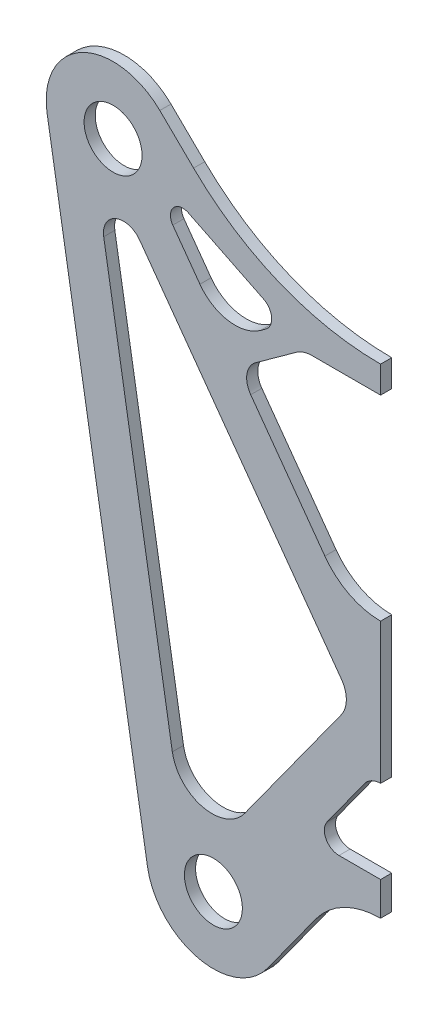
from build123d import *

# Parameters (mm, degrees)
SKIZZE1_R                       = 13
AUFSATZ_LINEAR_AUSTRAGEN1_DEPTH = 5


with BuildPart() as part:
    # Skizze1 → Aufsatz-Linear austragen1 (new body)
    with BuildSketch(Plane.XY):
        with BuildLine():
            Line((-68.917466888, 5.058071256), (-68.917466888, -7.004742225))
            Line((-68.917466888, -7.004742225), (-93.917466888, -7.004742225))
            Line((-93.917466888, -7.004742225), (-99.767100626, -7.004742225))
            ThreePointArc((-99.767100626, -7.004742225), (-103.417007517, -7.580180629), (-106.712824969, -9.250670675))
            Line((-106.712824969, -9.250670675), (-124.99823703, -22.456801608))
            ThreePointArc((-124.99823703, -22.456801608), (-128.882450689, -28.755133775), (-127.175411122, -35.955280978))
            Line((-127.175411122, -35.955280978), (-93.917466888, -82.004742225))
            ThreePointArc((-93.917466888, -82.004742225), (-82.95669341, -91.406484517), (-68.917466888, -94.787524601))
            Line((-68.917466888, -94.787524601), (-68.917466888, -157.822340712))
            ThreePointArc((-68.917466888, -157.822340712), (-72.966764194, -158.797525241), (-76.128151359, -161.509245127))
            Line((-76.128151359, -161.509245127), (-92.902204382, -184.734857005))
            ThreePointArc((-92.902204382, -184.734857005), (-93.425689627, -191.572100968), (-87.5763823, -195.150864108))
            Line((-87.5763823, -195.150864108), (-68.917466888, -195.150864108))
            Line((-68.917466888, -195.150864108), (-68.917466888, -210.207672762))
            ThreePointArc((-68.917466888, -210.207672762), (-85.274761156, -214.146968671), (-98.045307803, -225.101066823))
            Line((-98.045307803, -225.101066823), (-119.597090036, -254.941996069))
            ThreePointArc((-119.597090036, -254.941996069), (-150.761705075, -266.586120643), (-173.509284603, -242.309249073))
            Line((-173.509284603, -242.309249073), (-218.509284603, 27.690750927))
            ThreePointArc((-218.509284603, 27.690750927), (-202.793389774, 59.220817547), (-167.942066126, 54.071090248))
            Line((-167.942066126, 54.071090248), (-152.789282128, 39.252448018))
            ThreePointArc((-152.789282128, 39.252448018), (-114.2047079, 13.935123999), (-68.917466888, 5.058071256))
        make_face()
        with Locations((-188.917466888, 32.622720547)):
            Circle(SKIZZE1_R, mode=Mode.SUBTRACT)
        with Locations((-143.917466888, -237.377279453)):
            Circle(SKIZZE1_R, mode=Mode.SUBTRACT)
        with BuildLine():
            Line((-155.167864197, 20.708662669), (-121.443837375, 4.09942834))
            ThreePointArc((-121.443837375, 4.09942834), (-117.79178714, -1.255466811), (-120.497897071, -7.145232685))
            Line((-120.497897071, -7.145232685), (-122.787009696, -8.798480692))
            ThreePointArc((-122.787009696, -8.798480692), (-137.27755855, -12.233957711), (-149.953173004, -4.416841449))
            Line((-149.953173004, -4.416841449), (-162.139421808, 12.456426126))
            ThreePointArc((-162.139421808, 12.456426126), (-161.879004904, 19.307356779), (-155.167864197, 20.708662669))
        make_face(mode=Mode.SUBTRACT)
        with BuildLine():
            Line((-86.530545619, -126.054784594), (-176.976100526, -0.8224778))
            ThreePointArc((-176.976100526, -0.8224778), (-187.720260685, 2.208939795), (-193.12292023, -7.560284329))
            Line((-193.12292023, -7.560284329), (-162.338462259, -192.267032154))
            ThreePointArc((-162.338462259, -192.267032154), (-148.62374008, -206.903778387), (-129.834310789, -199.883429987))
            Line((-129.834310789, -199.883429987), (-86.530545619, -139.924370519))
            ThreePointArc((-86.530545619, -139.924370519), (-84.288151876, -132.989577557), (-86.530545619, -126.054784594))
        make_face(mode=Mode.SUBTRACT)
    extrude(amount=AUFSATZ_LINEAR_AUSTRAGEN1_DEPTH)


solid = part.part
